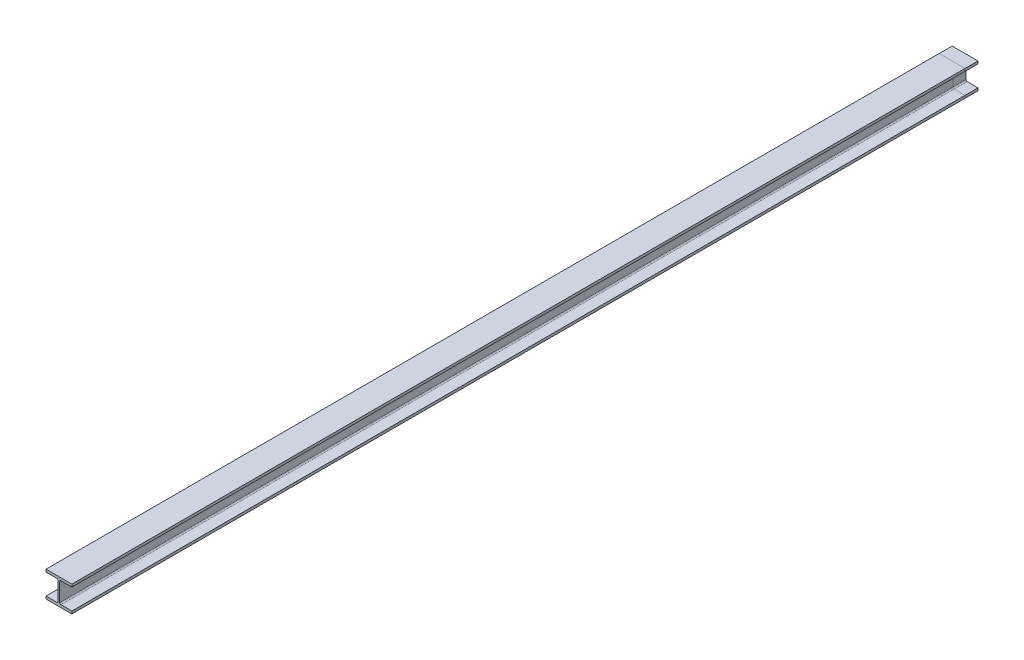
from build123d import *

# Parameters (mm, degrees)
BOSS_EXTRUDE1_DEPTH = 1750


with BuildPart() as part:
    # Sketch1 → Boss-Extrude1 (new, symmetric)
    with BuildSketch(Plane.XY):
        with BuildLine():
            Line((-50, 50), (50, 50))
            Line((50, 50), (50, 40))
            Line((50, 40), (8, 40))
            ThreePointArc((8, 40), (4.464466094, 38.535533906), (3, 35))
            Line((3, 35), (3, -35))
            ThreePointArc((3, -35), (4.464466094, -38.535533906), (8, -40))
            Line((8, -40), (50, -40))
            Line((50, -40), (50, -50))
            Line((50, -50), (-50, -50))
            Line((-50, -50), (-50, -40))
            Line((-50, -40), (-8, -40))
            ThreePointArc((-8, -40), (-4.464466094, -38.535533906), (-3, -35))
            Line((-3, -35), (-3, 35))
            ThreePointArc((-3, 35), (-4.464466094, 38.535533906), (-8, 40))
            Line((-8, 40), (-50, 40))
            Line((-50, 40), (-50, 50))
        make_face()
    extrude(amount=BOSS_EXTRUDE1_DEPTH, both=True)


solid = part.part
